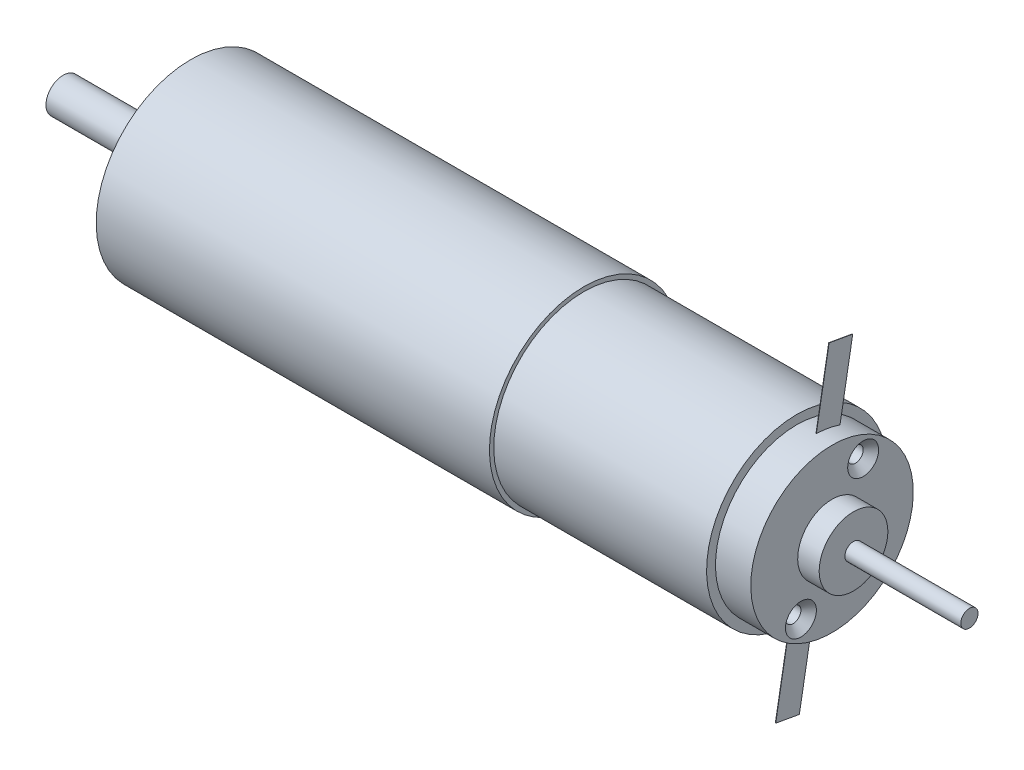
from build123d import *

# Parameters (mm, degrees)
CUT_EXTRUDE2_DEPTH                              = 63.613277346
CUT_EXTRUDE2_DEPTH_BACK                         = 63.613277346
SKETCH6_W                                       = 12.637138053
SKETCH6_H                                       = 3.681214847
EXTRUDE1_START                                  = 2
EXTRUDE1_DEPTH                                  = 0.04
M2_5X0_45_TAPPED_HOLE1_D                        = 2.05
M2_5X0_45_TAPPED_HOLE1_DEPTH                    = 5.35
M2_5X0_45_TAPPED_HOLE1_TIP                      = 0.615882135
CSK_FOR_M1_6_COUNTERSUNK_FLAT_HEAD1_D           = 1.8
CSK_FOR_M1_6_COUNTERSUNK_FLAT_HEAD1_DEPTH       = 4.35
CSK_FOR_M1_6_COUNTERSUNK_FLAT_HEAD1_CSINK_D     = 3.6
CSK_FOR_M1_6_COUNTERSUNK_FLAT_HEAD1_CSINK_ANGLE = 90
CSK_FOR_M1_6_COUNTERSUNK_FLAT_HEAD1_TIP         = 0.540774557


with BuildPart() as part:
    # Sketch1 → Revolve1 (revolve)
    with BuildSketch(Plane.XY, mode=Mode.PRIVATE) as revolve1_sk:
        Polygon((0, -10.5), (24.7852, -10.5), (24.7852, -9.4615), (28.9, -9.4615), (28.9, -4), (31.4, -4), (31.4, -1), (44.9, -1), (44.9, 0), (-60.65, 0), (-60.65, -2), (-48.95, -2), (-48.95, -3.4925), (-47.15, -3.4925), (-47.15, -5), (-45.8, -5), (-45.8, -11), (0, -11), align=None)
    revolve(revolve1_sk.sketch.rotate(Axis((44.9, 0, 0), (-1, 0, 0)), 180), axis=Axis((44.9, 0, 0), (-1, 0, 0)))

    # Sketch6 → Cut-Extrude2 (cut, two sides: drawn at the far end of the back side and taken through both)
    with BuildSketch(Plane(origin=(0, 0, 0), x_dir=(1, 0, 0), z_dir=(0, 1, 0)).offset(-CUT_EXTRUDE2_DEPTH_BACK)):
        with Locations((-57.668569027, 3.340607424)):
            Rectangle(SKETCH6_W, SKETCH6_H)
    extrude(amount=CUT_EXTRUDE2_DEPTH + CUT_EXTRUDE2_DEPTH_BACK, mode=Mode.SUBTRACT)

    # Sketch2 → Extrude1 (add)
    with BuildSketch(Plane(origin=(24.7852, 0, 0), x_dir=(0, 0, -1), z_dir=(1, 0, 0)).offset(EXTRUDE1_START)):
        Polygon((1.729571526, 17.871166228), (-0.452413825, 5.496512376), (2.305047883, 5.010297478), (4.487033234, 17.38495133), align=None)
        Polygon((-4.487033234, -17.38495133), (-1.729571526, -17.871166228), (0.452413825, -5.496512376), (-2.305047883, -5.010297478), align=None)
    extrude(amount=EXTRUDE1_DEPTH)

    # M2.5x0.45 Tapped Hole1
    with Locations(Plane.ZY.offset(45.8)):
        with Locations((0, 7), (6.062177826, -3.5), (-6.062177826, -3.5)):
            Hole(M2_5X0_45_TAPPED_HOLE1_D / 2, depth=M2_5X0_45_TAPPED_HOLE1_DEPTH)
            with Locations((0, 0, -(M2_5X0_45_TAPPED_HOLE1_DEPTH + M2_5X0_45_TAPPED_HOLE1_TIP / 2))):  # 118° drill point
                Cone(0, M2_5X0_45_TAPPED_HOLE1_D / 2, M2_5X0_45_TAPPED_HOLE1_TIP, mode=Mode.SUBTRACT)

    # CSK for M1.6 Countersunk Flat Head1
    with Locations(Plane(origin=(28.9, 0, 0), x_dir=(0, 0, -1), z_dir=(1, 0, 0))):
        with Locations((3.625, 6.278684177), (-3.625, -6.278684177)):
            CounterSinkHole(CSK_FOR_M1_6_COUNTERSUNK_FLAT_HEAD1_D / 2, CSK_FOR_M1_6_COUNTERSUNK_FLAT_HEAD1_CSINK_D / 2, depth=CSK_FOR_M1_6_COUNTERSUNK_FLAT_HEAD1_DEPTH, counter_sink_angle=CSK_FOR_M1_6_COUNTERSUNK_FLAT_HEAD1_CSINK_ANGLE)
            with Locations((0, 0, -(CSK_FOR_M1_6_COUNTERSUNK_FLAT_HEAD1_DEPTH + CSK_FOR_M1_6_COUNTERSUNK_FLAT_HEAD1_TIP / 2))):  # 118° drill point
                Cone(0, CSK_FOR_M1_6_COUNTERSUNK_FLAT_HEAD1_D / 2, CSK_FOR_M1_6_COUNTERSUNK_FLAT_HEAD1_TIP, mode=Mode.SUBTRACT)


solid = part.part
